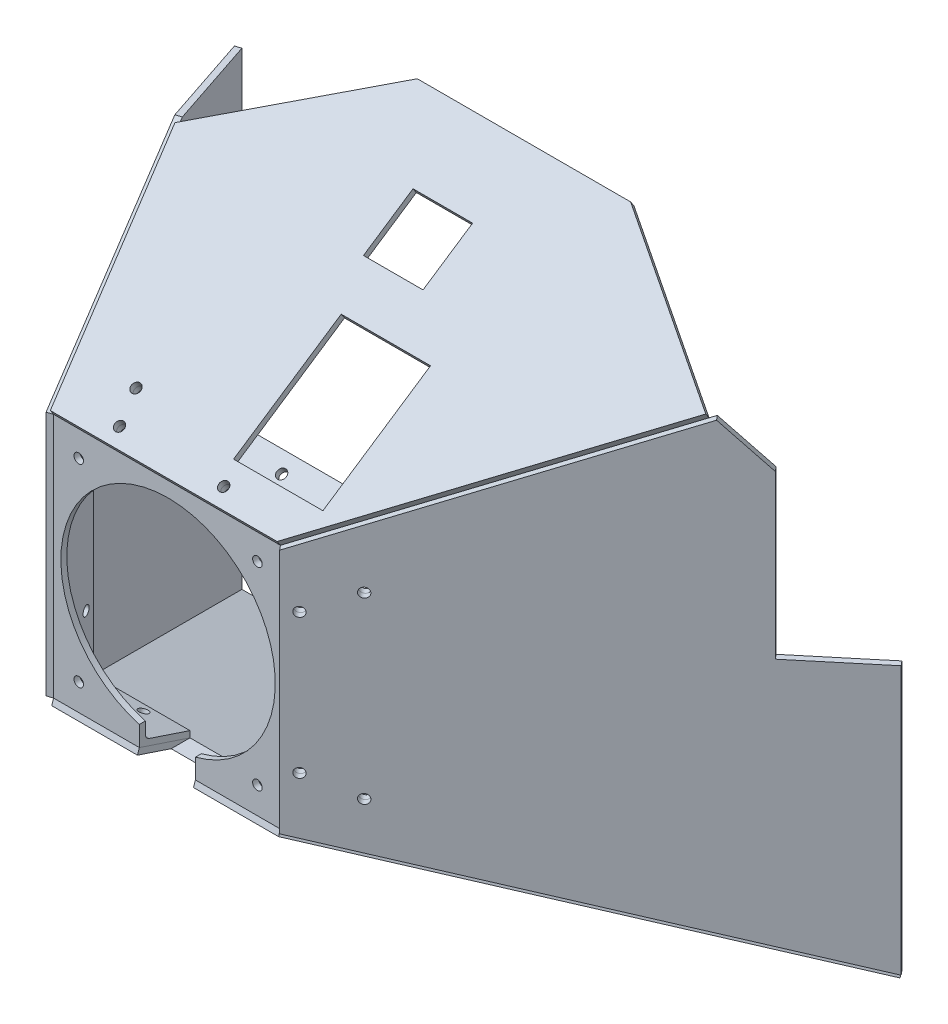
from build123d import *

# Parameters (mm, degrees)
SHELL_1_T            = 2
SKETCH_1_6_R         = 1.6
SKETCH_1_6_R_2       = 36
CUT_EXTRUDE_6_DEPTH  = 80.684119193
SKETCH_4_R           = 1.6
CUT_EXTRUDE_7_DEPTH  = 86.798335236
SKETCH_5_R           = 1.6
CUT_EXTRUDE_8_DEPTH  = 101.464915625
SKETCH_6_R           = 1.6
CUT_EXTRUDE_9_DEPTH  = 2
FILLET_1_R           = 2
SKETCH_11_R          = 1.6
CUT_EXTRUDE_10_DEPTH = 2
SKETCH_12_R          = 1.6
EXTRUDE_6_DEPTH      = 2
SKETCH_13_R          = 1.6
EXTRUDE_7_DEPTH      = 2
SKETCH_14_R          = 1.6
EXTRUDE_8_DEPTH      = 2
SKETCH_15_R          = 1.6
EXTRUDE_9_DEPTH      = 2
SKETCH_20_W          = 18.802329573
SKETCH_20_H          = 17.286076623
CUT_EXTRUDE_13_DEPTH = 122
SKETCH_24_W          = 57.646594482
SKETCH_24_H          = 110.373467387
CUT_EXTRUDE_17_DEPTH = 3
SKETCH_26_W          = 20
SKETCH_26_H          = 20
CUT_EXTRUDE_19_DEPTH = 3
SKETCH_27_W          = 30
SKETCH_27_H          = 43.431457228
CUT_EXTRUDE_20_DEPTH = 3
SKETCH_28_W          = 69.506159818
SKETCH_28_H          = 32.259838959
CUT_EXTRUDE_21_DEPTH = 3
CHAMFER_1_SIZE       = 60
CHAMFER_1_SIZE2      = 40
CHAMFER_2_SIZE       = 50
CHAMFER_2_SIZE2      = 90
CHAMFER_3_SIZE       = 20
CHAMFER_3_SIZE2      = 15.240746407


with BuildPart() as part:
    # Sketch 1 → Loft 2 section 0
    with BuildSketch(Plane.XY):
        with BuildLine():
            Line((-37, 40), (-37, -40))
            Line((-37, -40), (37, -40))
            Line((37, -40), (37, 40))
            Line((37, 40), (-37, 40))
        make_face()
    # Sketch 2 → Loft 2 section 1
    with BuildSketch(Plane.XY.offset(-15)):
        with BuildLine():
            Line((55, 50), (-42, 50))
            Line((-42, 50), (-42, -45))
            Line((-42, -45), (55, -45))
            Line((55, -45), (55, 50))
        make_face()
    loft()

    # Shell 1
    shell_1_openings = [part.faces().sort_by_distance(p)[0] for p in [
        (6.5, 2.5, -15),
    ]]
    offset(amount=SHELL_1_T, openings=shell_1_openings, kind=Kind.INTERSECTION)

    # Sketch 1_6 → Cut-Extrude 6 (cut, through all)
    with BuildSketch(Plane.XY):
        with Locations((30, -32.5)):
            Circle(SKETCH_1_6_R)
        with Locations((-30, 32.5)):
            Circle(SKETCH_1_6_R)
        with Locations((30, 32.5)):
            Circle(SKETCH_1_6_R)
        Circle(SKETCH_1_6_R_2)
        with Locations((-30, -32.5)):
            Circle(SKETCH_1_6_R)
    extrude(amount=CUT_EXTRUDE_6_DEPTH, mode=Mode.SUBTRACT)

    # Sketch 4 → Cut-Extrude 7 (cut, through all)
    with BuildSketch(Plane(origin=(15.163934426, 0, 18.196721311), x_dir=(-0.7682212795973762, 0, 0.6401843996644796), z_dir=(-0.6401843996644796, 0, -0.7682212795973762))):
        with Locations((-47.854936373, 30)):
            Circle(SKETCH_4_R)
        with Locations((-32.424187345, 23.414316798)):
            Circle(SKETCH_4_R)
        with Locations((-32.424187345, -23.414316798)):
            Circle(SKETCH_4_R)
        with Locations((-47.854936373, -30)):
            Circle(SKETCH_4_R)
    extrude(amount=-CUT_EXTRUDE_7_DEPTH, mode=Mode.SUBTRACT)

    # Sketch 5 → Cut-Extrude 8 (cut, through all)
    with BuildSketch(Plane(origin=(0, 27.692307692, 18.461538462), x_dir=(1, 0, 0), z_dir=(0, -0.8320502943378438, -0.554700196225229))):
        with Locations(Location((-22.211116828, -36.215764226, 0), (0, 0, 270))):
            Circle(SKETCH_5_R)
        with Locations(Location((-19.429917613, -26.188007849, 0), (0, 0, 270))):
            Circle(SKETCH_5_R)
        with Locations(Location((15.557586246, -26.188007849, 0), (0, 0, 270))):
            Circle(SKETCH_5_R)
        with Locations(Location((25.56990342, -36.215764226, 0), (0, 0, 270))):
            Circle(SKETCH_5_R)
    extrude(amount=-CUT_EXTRUDE_8_DEPTH, mode=Mode.SUBTRACT)

    # Sketch 6 → Cut-Extrude 9 (cut)
    with BuildSketch(Plane(origin=(-33.3, 0, 11.1), x_dir=(-0.3162277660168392, 0, -0.9486832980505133), z_dir=(0.9486832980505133, 0, -0.3162277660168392))):
        with Locations((15.700427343, 18.865502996)):
            Circle(SKETCH_6_R)
        with Locations((23.511815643, 23.805858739)):
            Circle(SKETCH_6_R)
        with Locations(Location((23.511815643, -23.805858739, 0), (0, 0, 180))):
            Circle(SKETCH_6_R)
        with Locations(Location((15.700427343, -18.865502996, 0), (0, 0, 180))):
            Circle(SKETCH_6_R)
    extrude(amount=-CUT_EXTRUDE_9_DEPTH, mode=Mode.SUBTRACT)

    # Fillet 1
    fillet_1_edges = [part.edges().sort_by_distance(p)[0] for p in [
        (-37, 0, 0),
        (0, -40, 0),
        (37, 0, 0),
        (0, 40, 0),
    ]]
    fillet(fillet_1_edges, radius=FILLET_1_R)

    # Sketch 11 → Cut-Extrude 10 (cut)
    with BuildSketch(Plane(origin=(0, -36, 12), x_dir=(1, 0, 0), z_dir=(0, 0.9486832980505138, -0.3162277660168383))):
        with Locations(Location((-22.06734818, 25.127165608, 0), (0, 0, 270))):
            Circle(SKETCH_11_R)
        with Locations(Location((-19.242199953, 16.193262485, 0), (0, 0, 270))):
            Circle(SKETCH_11_R)
        with Locations(Location((13.76012962, 16.193262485, 0), (0, 0, 270))):
            Circle(SKETCH_11_R)
        with Locations(Location((23.930663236, 25.127165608, 0), (0, 0, 270))):
            Circle(SKETCH_11_R)
    extrude(amount=-CUT_EXTRUDE_10_DEPTH, mode=Mode.SUBTRACT)


with BuildPart() as body_2:
    # Sketch 12 → Extrude 6 (new body)
    with BuildSketch(Plane(origin=(-35.197366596, 0, 11.732455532), x_dir=(0.3162277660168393, 0, 0.9486832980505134), z_dir=(-0.9486832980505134, 0, 0.3162277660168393))):
        Polygon((-28.17848231, 52.40370085), (-110.258908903, 104.31592072), (-110.258908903, -73.064295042), (-28.17848231, -47.108185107), (-10.258908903, -41.44151844), (-10.258908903, 41.070367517), align=None)
        with Locations((-23.511815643, -23.805858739)):
            Circle(SKETCH_12_R, mode=Mode.SUBTRACT)
        with Locations((-15.700427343, -18.865502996)):
            Circle(SKETCH_12_R, mode=Mode.SUBTRACT)
        with Locations((-15.700427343, 18.865502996)):
            Circle(SKETCH_12_R, mode=Mode.SUBTRACT)
        with Locations((-23.511815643, 23.805858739)):
            Circle(SKETCH_12_R, mode=Mode.SUBTRACT)
    extrude(amount=EXTRUDE_6_DEPTH)

    # Sketch 28 → Cut-Extrude 21 (cut)
    with BuildSketch(Plane(origin=(-35.197366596, 0, 11.732455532), x_dir=(-0.3162277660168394, 0, -0.9486832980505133), z_dir=(0.9486832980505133, 0, -0.3162277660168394))):
        with Locations((95.011988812, 100.445840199)):
            Rectangle(SKETCH_28_W, SKETCH_28_H)
    extrude(amount=-CUT_EXTRUDE_21_DEPTH, mode=Mode.SUBTRACT)


with BuildPart() as body_3:
    # Sketch 13 → Extrude 7 (new body)
    with BuildSketch(Plane(origin=(0, -37.897366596, 12.632455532), x_dir=(1, 0, 0), z_dir=(0, -0.9486832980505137, 0.31622776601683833))):
        Polygon((-44.108185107, -29.127165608), (-70.064295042, -111.207592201), (151.566095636, -111.207592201), (58.12409987, -29.127165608), (37.72409987, -11.207592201), (-38.44151844, -11.207592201), align=None)
        with Locations(Location((23.930663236, -25.127165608, 0), (0, 0, 270))):
            Circle(SKETCH_13_R, mode=Mode.SUBTRACT)
        with Locations(Location((13.76012962, -16.193262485, 0), (0, 0, 270))):
            Circle(SKETCH_13_R, mode=Mode.SUBTRACT)
        with Locations(Location((-22.06734818, -25.127165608, 0), (0, 0, 270))):
            Circle(SKETCH_13_R, mode=Mode.SUBTRACT)
        with Locations(Location((-19.242199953, -16.193262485, 0), (0, 0, 270))):
            Circle(SKETCH_13_R, mode=Mode.SUBTRACT)
    extrude(amount=EXTRUDE_7_DEPTH)


with BuildPart() as body_4:
    # Sketch 14 → Extrude 8 (new body)
    with BuildSketch(Plane(origin=(16.444303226, 0, 19.733163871), x_dir=(0.7682212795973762, 0, -0.6401843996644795), z_dir=(0.6401843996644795, 0, 0.7682212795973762))):
        Polygon((54.254936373, -47.108185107), (175.889155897, -73.064295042), (175.889155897, 104.31592072), (54.254936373, 52.40370085), (27.700087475, 41.070367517), (27.700087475, -41.44151844), align=None)
        with Locations((47.854936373, 30)):
            Circle(SKETCH_14_R, mode=Mode.SUBTRACT)
        with Locations((32.424187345, 23.414316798)):
            Circle(SKETCH_14_R, mode=Mode.SUBTRACT)
        with Locations((32.424187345, -23.414316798)):
            Circle(SKETCH_14_R, mode=Mode.SUBTRACT)
        with Locations((47.854936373, -30)):
            Circle(SKETCH_14_R, mode=Mode.SUBTRACT)
    extrude(amount=EXTRUDE_8_DEPTH)

    # Sketch 24 → Cut-Extrude 17 (cut)
    with BuildSketch(Plane(origin=(17.724672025, 0, 21.26960643), x_dir=(0.7682212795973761, 0, -0.6401843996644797), z_dir=(0.6401843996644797, 0, 0.7682212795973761))):
        with Locations((174.712453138, 72.122438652)):
            Rectangle(SKETCH_24_W, SKETCH_24_H)
    extrude(amount=-CUT_EXTRUDE_17_DEPTH, mode=Mode.SUBTRACT)

    # Chamfer 3
    chamfer_3_edges = [body_4.edges().sort_by_distance(p)[0] for p in [
        (129.159641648, 91.512232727, -72.894576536),
    ]]
    chamfer_3_side = [body_4.faces().sort_by_distance(p)[0] for p in [
        (129.159641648, 54.223968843, -72.894576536),
    ]]
    chamfer(chamfer_3_edges, length=CHAMFER_3_SIZE, length2=CHAMFER_3_SIZE2, reference=chamfer_3_side[0])


with BuildPart() as body_5:
    # Sketch 15 → Extrude 9 (new body)
    with BuildSketch(Plane(origin=(0, 29.356408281, 19.570938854), x_dir=(1, 0, 0), z_dir=(0, 0.8320502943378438, 0.5547001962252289))):
        Polygon((58.12409987, 41.54909756), (151.566095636, 135.135182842), (-70.064295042, 135.135182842), (-44.108185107, 41.54909756), (-38.44151844, 21.117640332), (37.72409987, 21.117640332), align=None)
        with Locations(Location((25.56990342, 36.215764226, 0), (0, 0, 270))):
            Circle(SKETCH_15_R, mode=Mode.SUBTRACT)
        with Locations(Location((15.557586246, 26.188007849, 0), (0, 0, 270))):
            Circle(SKETCH_15_R, mode=Mode.SUBTRACT)
        with Locations(Location((-22.211116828, 36.215764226, 0), (0, 0, 270))):
            Circle(SKETCH_15_R, mode=Mode.SUBTRACT)
        with Locations(Location((-19.429917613, 26.188007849, 0), (0, 0, 270))):
            Circle(SKETCH_15_R, mode=Mode.SUBTRACT)
    extrude(amount=EXTRUDE_9_DEPTH)

    # Sketch 26 → Cut-Extrude 19 (cut)
    with BuildSketch(Plane(origin=(0, 29.356408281, 19.570938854), x_dir=(1, 0, 0), z_dir=(0, -0.8320502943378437, -0.5547001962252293))):
        with Locations((18.12409987, -101.54909756)):
            Rectangle(SKETCH_26_W, SKETCH_26_H)
    extrude(amount=-CUT_EXTRUDE_19_DEPTH, mode=Mode.SUBTRACT)

    # Sketch 27 → Cut-Extrude 20 (cut)
    with BuildSketch(Plane(origin=(0, 29.356408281, 19.570938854), x_dir=(1, 0, 0), z_dir=(0, -0.8320502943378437, -0.5547001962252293))):
        with Locations((28.12409987, -54.833368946)):
            Rectangle(SKETCH_27_W, SKETCH_27_H)
    extrude(amount=-CUT_EXTRUDE_20_DEPTH, mode=Mode.SUBTRACT)

    # Chamfer 1
    chamfer_1_edges = [body_5.edges().sort_by_distance(p)[0] for p in [
        (-70.064295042, 105.147971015, -92.313629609),
    ]]
    chamfer_1_side = [body_5.faces().sort_by_distance(p)[0] for p in [
        (40.750900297, 105.147971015, -92.313629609),
    ]]
    chamfer(chamfer_1_edges, length=CHAMFER_1_SIZE, length2=CHAMFER_1_SIZE2, reference=chamfer_1_side[0])

    # Chamfer 2
    chamfer_2_edges = [body_5.edges().sort_by_distance(p)[0] for p in [
        (151.566095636, 105.147971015, -92.313629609),
    ]]
    chamfer_2_side = [body_5.faces().sort_by_distance(p)[0] for p in [
        (94.645097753, 73.525194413, -44.879464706),
    ]]
    chamfer(chamfer_2_edges, length=CHAMFER_2_SIZE, length2=CHAMFER_2_SIZE2, reference=chamfer_2_side[0])


with BuildPart() as cut_extrude_13_tool:
    # Sketch 20 → Cut-Extrude 13 (new, symmetric)
    with BuildSketch(Plane.XY.offset(2)):
        with Locations((-0.241035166, -38.465146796)):
            Rectangle(SKETCH_20_W, SKETCH_20_H)
    extrude(amount=CUT_EXTRUDE_13_DEPTH, both=True)


with BuildPart() as part_1:
    add(part.part)

    # Cut-Extrude 13: cut by cut_extrude_13_tool
    add(cut_extrude_13_tool.part, mode=Mode.SUBTRACT)


with BuildPart() as body_3_1:
    add(body_3.part)

    # Cut-Extrude 13: cut by cut_extrude_13_tool
    add(cut_extrude_13_tool.part, mode=Mode.SUBTRACT)


solid = Compound([body_2.part, body_4.part, body_5.part, part_1.part, body_3_1.part])
